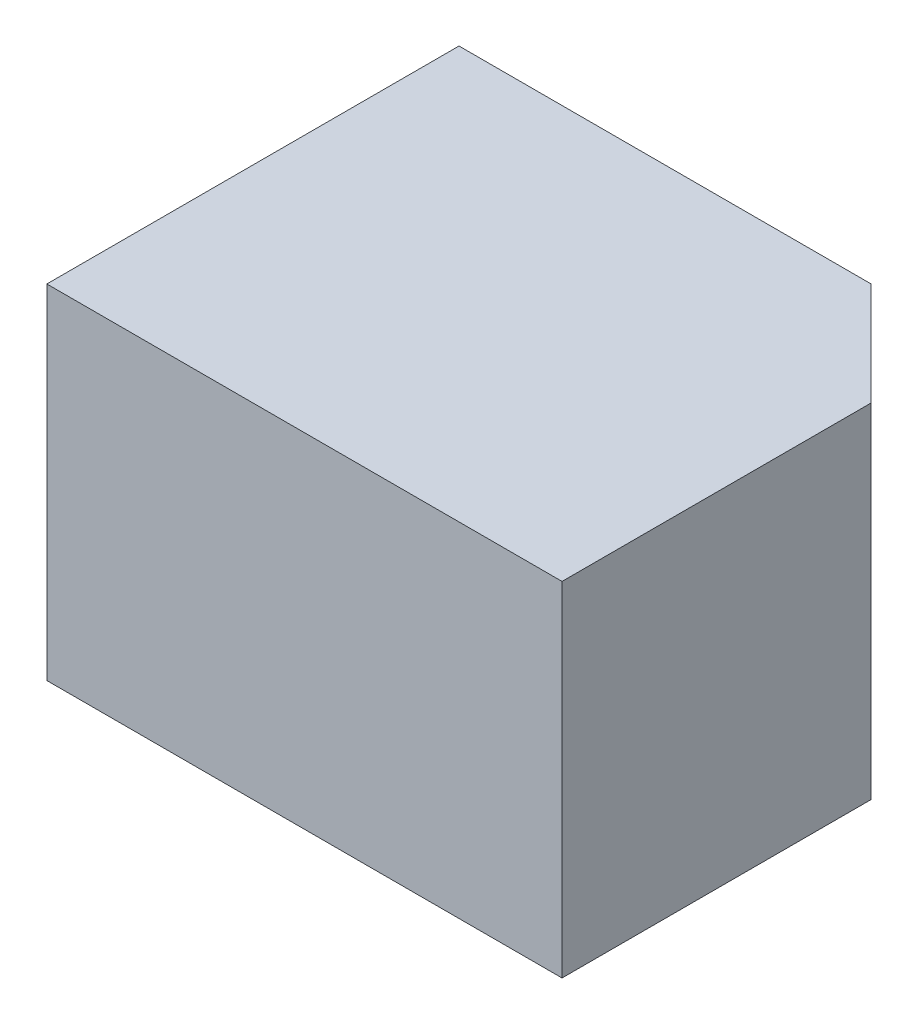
ISO-10303-21;
HEADER;
FILE_DESCRIPTION(('STEP AP214'),'2;1');
FILE_NAME('part.step','',(''),(''),'','','');
FILE_SCHEMA(('AUTOMOTIVE_DESIGN { 1 0 10303 214 1 1 1 1 }'));
ENDSEC;
DATA;
#1=APPLICATION_CONTEXT('core data for automotive mechanical design processes');
#2=APPLICATION_PROTOCOL_DEFINITION('international standard','automotive_design',2000,#1);
#3=PRODUCT_CONTEXT('',#1,'mechanical');
#4=PRODUCT('Part','Part','',(#3));
#5=PRODUCT_RELATED_PRODUCT_CATEGORY('part','',(#4));
#6=PRODUCT_DEFINITION_FORMATION('','',#4);
#7=PRODUCT_DEFINITION_CONTEXT('part definition',#1,'design');
#8=PRODUCT_DEFINITION('design','',#6,#7);
#9=PRODUCT_DEFINITION_SHAPE('','',#8);
#10=(LENGTH_UNIT() NAMED_UNIT(*) SI_UNIT(.MILLI.,.METRE.));
#11=(NAMED_UNIT(*) PLANE_ANGLE_UNIT() SI_UNIT($,.RADIAN.));
#12=(NAMED_UNIT(*) SI_UNIT($,.STERADIAN.) SOLID_ANGLE_UNIT());
#13=UNCERTAINTY_MEASURE_WITH_UNIT(LENGTH_MEASURE(1.E-05),#10,'distance_accuracy_value','');
#14=(GEOMETRIC_REPRESENTATION_CONTEXT(3) GLOBAL_UNCERTAINTY_ASSIGNED_CONTEXT((#13)) GLOBAL_UNIT_ASSIGNED_CONTEXT((#10,
#11,#12)) REPRESENTATION_CONTEXT('',''));
#15=CARTESIAN_POINT('',(0.,0.,0.));
#16=DIRECTION('',(0.,0.,1.));
#17=DIRECTION('',(1.,0.,0.));
#18=AXIS2_PLACEMENT_3D('',#15,#16,#17);
#19=CARTESIAN_POINT('',(-4.42379489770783,5.,-3.53903591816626));
#20=DIRECTION('',(1.,0.,0.));
#21=DIRECTION('',(0.,0.,-1.));
#22=AXIS2_PLACEMENT_3D('',#19,#20,#21);
#23=PLANE('',#22);
#24=DIRECTION('',(0.,0.,1.));
#25=VECTOR('',#24,1.);
#26=CARTESIAN_POINT('',(-4.42379489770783,0.,-3.53903591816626));
#27=LINE('',#26,#25);
#28=CARTESIAN_POINT('',(-4.42379489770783,0.,-3.53903591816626));
#29=VERTEX_POINT('',#28);
#30=CARTESIAN_POINT('',(-4.42379489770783,0.,2.46096408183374));
#31=VERTEX_POINT('',#30);
#32=EDGE_CURVE('E126',#29,#31,#27,.T.);
#33=ORIENTED_EDGE('',*,*,#32,.T.);
#34=DIRECTION('',(0.,-1.,0.));
#35=VECTOR('',#34,1.);
#36=CARTESIAN_POINT('',(-4.42379489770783,5.,2.46096408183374));
#37=LINE('',#36,#35);
#38=CARTESIAN_POINT('',(-4.42379489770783,5.,2.46096408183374));
#39=VERTEX_POINT('',#38);
#40=EDGE_CURVE('E44',#39,#31,#37,.T.);
#41=ORIENTED_EDGE('',*,*,#40,.F.);
#42=DIRECTION('',(0.,0.,1.));
#43=VECTOR('',#42,1.);
#44=CARTESIAN_POINT('',(-4.42379489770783,5.,-3.53903591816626));
#45=LINE('',#44,#43);
#46=CARTESIAN_POINT('',(-4.42379489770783,5.,-3.53903591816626));
#47=VERTEX_POINT('',#46);
#48=EDGE_CURVE('E137',#47,#39,#45,.T.);
#49=ORIENTED_EDGE('',*,*,#48,.F.);
#50=DIRECTION('',(0.,-1.,0.));
#51=VECTOR('',#50,1.);
#52=CARTESIAN_POINT('',(-4.42379489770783,5.,-3.53903591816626));
#53=LINE('',#52,#51);
#54=EDGE_CURVE('E122',#47,#29,#53,.T.);
#55=ORIENTED_EDGE('',*,*,#54,.T.);
#56=EDGE_LOOP('',(#33,#41,#49,#55));
#57=FACE_BOUND('',#56,.T.);
#58=ADVANCED_FACE('F37',(#57),#23,.F.);
#59=CARTESIAN_POINT('',(3.07620510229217,5.,2.46096408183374));
#60=DIRECTION('',(0.,0.,-1.));
#61=DIRECTION('',(-1.,0.,0.));
#62=AXIS2_PLACEMENT_3D('',#59,#60,#61);
#63=PLANE('',#62);
#64=DIRECTION('',(1.,0.,0.));
#65=VECTOR('',#64,1.);
#66=CARTESIAN_POINT('',(3.07620510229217,0.,2.46096408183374));
#67=LINE('',#66,#65);
#68=CARTESIAN_POINT('',(3.07620510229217,0.,2.46096408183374));
#69=VERTEX_POINT('',#68);
#70=EDGE_CURVE('E129',#31,#69,#67,.T.);
#71=ORIENTED_EDGE('',*,*,#70,.T.);
#72=DIRECTION('',(0.,-1.,0.));
#73=VECTOR('',#72,1.);
#74=CARTESIAN_POINT('',(3.07620510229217,5.,2.46096408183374));
#75=LINE('',#74,#73);
#76=CARTESIAN_POINT('',(3.07620510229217,5.,2.46096408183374));
#77=VERTEX_POINT('',#76);
#78=EDGE_CURVE('E116',#77,#69,#75,.T.);
#79=ORIENTED_EDGE('',*,*,#78,.F.);
#80=DIRECTION('',(1.,0.,0.));
#81=VECTOR('',#80,1.);
#82=CARTESIAN_POINT('',(3.07620510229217,5.,2.46096408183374));
#83=LINE('',#82,#81);
#84=EDGE_CURVE('E93',#39,#77,#83,.T.);
#85=ORIENTED_EDGE('',*,*,#84,.F.);
#86=ORIENTED_EDGE('',*,*,#40,.T.);
#87=EDGE_LOOP('',(#71,#79,#85,#86));
#88=FACE_BOUND('',#87,.T.);
#89=ADVANCED_FACE('F141',(#88),#63,.F.);
#90=CARTESIAN_POINT('',(3.07620510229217,5.,-2.03903591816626));
#91=DIRECTION('',(-1.,0.,0.));
#92=DIRECTION('',(0.,0.,1.));
#93=AXIS2_PLACEMENT_3D('',#90,#91,#92);
#94=PLANE('',#93);
#95=DIRECTION('',(0.,0.,-1.));
#96=VECTOR('',#95,1.);
#97=CARTESIAN_POINT('',(3.07620510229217,0.,-2.03903591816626));
#98=LINE('',#97,#96);
#99=CARTESIAN_POINT('',(3.07620510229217,0.,-2.03903591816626));
#100=VERTEX_POINT('',#99);
#101=EDGE_CURVE('E112',#69,#100,#98,.T.);
#102=ORIENTED_EDGE('',*,*,#101,.T.);
#103=DIRECTION('',(0.,-1.,0.));
#104=VECTOR('',#103,1.);
#105=CARTESIAN_POINT('',(3.07620510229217,5.,-2.03903591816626));
#106=LINE('',#105,#104);
#107=CARTESIAN_POINT('',(3.07620510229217,5.,-2.03903591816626));
#108=VERTEX_POINT('',#107);
#109=EDGE_CURVE('E109',#108,#100,#106,.T.);
#110=ORIENTED_EDGE('',*,*,#109,.F.);
#111=DIRECTION('',(0.,0.,-1.));
#112=VECTOR('',#111,1.);
#113=CARTESIAN_POINT('',(3.07620510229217,5.,-2.03903591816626));
#114=LINE('',#113,#112);
#115=EDGE_CURVE('E99',#77,#108,#114,.T.);
#116=ORIENTED_EDGE('',*,*,#115,.F.);
#117=ORIENTED_EDGE('',*,*,#78,.T.);
#118=EDGE_LOOP('',(#102,#110,#116,#117));
#119=FACE_BOUND('',#118,.T.);
#120=ADVANCED_FACE('F110',(#119),#94,.F.);
#121=CARTESIAN_POINT('',(1.57620510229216,5.,-3.53903591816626));
#122=DIRECTION('',(-0.707106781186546,0.,0.707106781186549));
#123=DIRECTION('',(0.707106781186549,0.,0.707106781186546));
#124=AXIS2_PLACEMENT_3D('',#121,#122,#123);
#125=PLANE('',#124);
#126=DIRECTION('',(0.707106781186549,0.,0.707106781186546));
#127=VECTOR('',#126,1.);
#128=CARTESIAN_POINT('',(1.57620510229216,0.79,-3.53903591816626));
#129=LINE('',#128,#127);
#130=CARTESIAN_POINT('',(1.78241219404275,0.79,-3.33282882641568));
#131=VERTEX_POINT('',#130);
#132=CARTESIAN_POINT('',(2.61999801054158,0.79,-2.49524300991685));
#133=VERTEX_POINT('',#132);
#134=EDGE_CURVE('E12',#131,#133,#129,.T.);
#135=ORIENTED_EDGE('',*,*,#134,.F.);
#136=DIRECTION('',(0.,-1.,0.));
#137=VECTOR('',#136,1.);
#138=CARTESIAN_POINT('',(1.78241219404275,0.79,-3.33282882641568));
#139=LINE('',#138,#137);
#140=CARTESIAN_POINT('',(1.78241219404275,0.,-3.33282882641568));
#141=VERTEX_POINT('',#140);
#142=EDGE_CURVE('E154',#131,#141,#139,.T.);
#143=ORIENTED_EDGE('',*,*,#142,.T.);
#144=DIRECTION('',(-0.707106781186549,0.,-0.707106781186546));
#145=VECTOR('',#144,1.);
#146=CARTESIAN_POINT('',(1.57620510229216,0.,-3.53903591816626));
#147=LINE('',#146,#145);
#148=CARTESIAN_POINT('',(1.57620510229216,0.,-3.53903591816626));
#149=VERTEX_POINT('',#148);
#150=EDGE_CURVE('E133',#141,#149,#147,.T.);
#151=ORIENTED_EDGE('',*,*,#150,.T.);
#152=DIRECTION('',(0.,-1.,0.));
#153=VECTOR('',#152,1.);
#154=CARTESIAN_POINT('',(1.57620510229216,5.,-3.53903591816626));
#155=LINE('',#154,#153);
#156=CARTESIAN_POINT('',(1.57620510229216,5.,-3.53903591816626));
#157=VERTEX_POINT('',#156);
#158=EDGE_CURVE('E117',#157,#149,#155,.T.);
#159=ORIENTED_EDGE('',*,*,#158,.F.);
#160=DIRECTION('',(-0.707106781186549,0.,-0.707106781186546));
#161=VECTOR('',#160,1.);
#162=CARTESIAN_POINT('',(1.57620510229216,5.,-3.53903591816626));
#163=LINE('',#162,#161);
#164=EDGE_CURVE('E103',#108,#157,#163,.T.);
#165=ORIENTED_EDGE('',*,*,#164,.F.);
#166=ORIENTED_EDGE('',*,*,#109,.T.);
#167=CARTESIAN_POINT('',(2.61999801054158,0.,-2.49524300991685));
#168=VERTEX_POINT('',#167);
#169=EDGE_CURVE('E134',#100,#168,#147,.T.);
#170=ORIENTED_EDGE('',*,*,#169,.T.);
#171=DIRECTION('',(0.,-1.,0.));
#172=VECTOR('',#171,1.);
#173=CARTESIAN_POINT('',(2.61999801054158,0.79,-2.49524300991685));
#174=LINE('',#173,#172);
#175=EDGE_CURVE('E51',#168,#133,#174,.F.);
#176=ORIENTED_EDGE('',*,*,#175,.T.);
#177=EDGE_LOOP('',(#135,#143,#151,#159,#165,#166,#170,#176));
#178=FACE_BOUND('',#177,.T.);
#179=ADVANCED_FACE('F120',(#178),#125,.F.);
#180=CARTESIAN_POINT('',(1.57620510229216,5.,-3.53903591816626));
#181=DIRECTION('',(0.,0.,1.));
#182=DIRECTION('',(1.,0.,0.));
#183=AXIS2_PLACEMENT_3D('',#180,#181,#182);
#184=PLANE('',#183);
#185=DIRECTION('',(-1.,0.,0.));
#186=VECTOR('',#185,1.);
#187=CARTESIAN_POINT('',(1.57620510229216,0.,-3.53903591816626));
#188=LINE('',#187,#186);
#189=EDGE_CURVE('E84',#149,#29,#188,.T.);
#190=ORIENTED_EDGE('',*,*,#189,.T.);
#191=ORIENTED_EDGE('',*,*,#54,.F.);
#192=DIRECTION('',(-1.,0.,0.));
#193=VECTOR('',#192,1.);
#194=CARTESIAN_POINT('',(1.57620510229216,5.,-3.53903591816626));
#195=LINE('',#194,#193);
#196=EDGE_CURVE('E60',#157,#47,#195,.T.);
#197=ORIENTED_EDGE('',*,*,#196,.F.);
#198=ORIENTED_EDGE('',*,*,#158,.T.);
#199=EDGE_LOOP('',(#190,#191,#197,#198));
#200=FACE_BOUND('',#199,.T.);
#201=ADVANCED_FACE('F207',(#200),#184,.F.);
#202=CARTESIAN_POINT('',(0.,5.,0.));
#203=DIRECTION('',(0.,-1.,0.));
#204=DIRECTION('',(0.,0.,-1.));
#205=AXIS2_PLACEMENT_3D('',#202,#203,#204);
#206=PLANE('',#205);
#207=ORIENTED_EDGE('',*,*,#48,.T.);
#208=ORIENTED_EDGE('',*,*,#84,.T.);
#209=ORIENTED_EDGE('',*,*,#115,.T.);
#210=ORIENTED_EDGE('',*,*,#164,.T.);
#211=ORIENTED_EDGE('',*,*,#196,.T.);
#212=EDGE_LOOP('',(#207,#208,#209,#210,#211));
#213=FACE_BOUND('',#212,.T.);
#214=ADVANCED_FACE('F101',(#213),#206,.F.);
#215=CARTESIAN_POINT('',(0.,0.,0.));
#216=DIRECTION('',(0.,-1.,0.));
#217=DIRECTION('',(0.,0.,-1.));
#218=AXIS2_PLACEMENT_3D('',#215,#216,#217);
#219=PLANE('',#218);
#220=CARTESIAN_POINT('',(-3.17379489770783,0.,-2.53903591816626));
#221=DIRECTION('',(0.,-1.,0.));
#222=DIRECTION('',(0.,0.,-1.));
#223=AXIS2_PLACEMENT_3D('',#220,#221,#222);
#224=CIRCLE('',#223,0.795);
#225=CARTESIAN_POINT('',(-3.17379489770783,0.,-3.33403591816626));
#226=VERTEX_POINT('',#225);
#227=EDGE_CURVE('E339',#226,#226,#224,.T.);
#228=ORIENTED_EDGE('',*,*,#227,.F.);
#229=EDGE_LOOP('',(#228));
#230=FACE_BOUND('',#229,.T.);
#231=CARTESIAN_POINT('',(1.82620510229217,0.,-2.53903591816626));
#232=DIRECTION('',(0.,-1.,0.));
#233=DIRECTION('',(0.,0.,-1.));
#234=AXIS2_PLACEMENT_3D('',#231,#232,#233);
#235=CIRCLE('',#234,0.795000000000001);
#236=EDGE_CURVE('E149',#168,#141,#235,.T.);
#237=ORIENTED_EDGE('',*,*,#236,.F.);
#238=ORIENTED_EDGE('',*,*,#169,.F.);
#239=ORIENTED_EDGE('',*,*,#101,.F.);
#240=ORIENTED_EDGE('',*,*,#70,.F.);
#241=ORIENTED_EDGE('',*,*,#32,.F.);
#242=ORIENTED_EDGE('',*,*,#189,.F.);
#243=ORIENTED_EDGE('',*,*,#150,.F.);
#244=EDGE_LOOP('',(#237,#238,#239,#240,#241,#242,#243));
#245=FACE_BOUND('',#244,.T.);
#246=CARTESIAN_POINT('',(1.82620510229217,0.,1.46096408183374));
#247=DIRECTION('',(0.,-1.,0.));
#248=DIRECTION('',(0.,0.,-1.));
#249=AXIS2_PLACEMENT_3D('',#246,#247,#248);
#250=CIRCLE('',#249,0.795000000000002);
#251=CARTESIAN_POINT('',(1.82620510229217,0.,0.665964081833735));
#252=VERTEX_POINT('',#251);
#253=EDGE_CURVE('E157',#252,#252,#250,.T.);
#254=ORIENTED_EDGE('',*,*,#253,.F.);
#255=EDGE_LOOP('',(#254));
#256=FACE_BOUND('',#255,.T.);
#257=CARTESIAN_POINT('',(-3.17379489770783,0.,1.46096408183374));
#258=DIRECTION('',(0.,-1.,0.));
#259=DIRECTION('',(0.,0.,-1.));
#260=AXIS2_PLACEMENT_3D('',#257,#258,#259);
#261=CIRCLE('',#260,0.795);
#262=CARTESIAN_POINT('',(-3.17379489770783,0.,0.665964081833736));
#263=VERTEX_POINT('',#262);
#264=EDGE_CURVE('E166',#263,#263,#261,.T.);
#265=ORIENTED_EDGE('',*,*,#264,.F.);
#266=EDGE_LOOP('',(#265));
#267=FACE_BOUND('',#266,.T.);
#268=CARTESIAN_POINT('',(-1.17379489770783,0.,-0.539035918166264));
#269=DIRECTION('',(0.,-1.,0.));
#270=DIRECTION('',(0.,0.,-1.));
#271=AXIS2_PLACEMENT_3D('',#268,#269,#270);
#272=CIRCLE('',#271,1.25);
#273=CARTESIAN_POINT('',(-1.17379489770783,0.,-1.78903591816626));
#274=VERTEX_POINT('',#273);
#275=EDGE_CURVE('E172',#274,#274,#272,.T.);
#276=ORIENTED_EDGE('',*,*,#275,.F.);
#277=EDGE_LOOP('',(#276));
#278=FACE_BOUND('',#277,.T.);
#279=ADVANCED_FACE('F146',(#230,#245,#256,#267,#278),#219,.T.);
#280=CARTESIAN_POINT('',(-1.17379489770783,8.53553390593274,-0.539035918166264));
#281=DIRECTION('',(0.,-1.,0.));
#282=DIRECTION('',(0.,0.,-1.));
#283=AXIS2_PLACEMENT_3D('',#280,#281,#282);
#284=CYLINDRICAL_SURFACE('',#283,1.25);
#285=CARTESIAN_POINT('',(-1.17379489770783,4.,-0.539035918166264));
#286=DIRECTION('',(0.,-1.,0.));
#287=DIRECTION('',(0.,0.,-1.));
#288=AXIS2_PLACEMENT_3D('',#285,#286,#287);
#289=CIRCLE('',#288,1.25);
#290=CARTESIAN_POINT('',(-1.17379489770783,4.,-1.78903591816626));
#291=VERTEX_POINT('',#290);
#292=EDGE_CURVE('E130',#291,#291,#289,.F.);
#293=ORIENTED_EDGE('',*,*,#292,.T.);
#294=EDGE_LOOP('',(#293));
#295=FACE_BOUND('',#294,.T.);
#296=ORIENTED_EDGE('',*,*,#275,.T.);
#297=EDGE_LOOP('',(#296));
#298=FACE_BOUND('',#297,.T.);
#299=ADVANCED_FACE('F181',(#295,#298),#284,.F.);
#300=CARTESIAN_POINT('',(0.,4.,0.));
#301=DIRECTION('',(0.,-1.,0.));
#302=DIRECTION('',(0.,0.,-1.));
#303=AXIS2_PLACEMENT_3D('',#300,#301,#302);
#304=PLANE('',#303);
#305=ORIENTED_EDGE('',*,*,#292,.F.);
#306=EDGE_LOOP('',(#305));
#307=FACE_BOUND('',#306,.T.);
#308=ADVANCED_FACE('F184',(#307),#304,.T.);
#309=CARTESIAN_POINT('',(-3.17379489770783,0.79,1.46096408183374));
#310=DIRECTION('',(0.,-1.,0.));
#311=DIRECTION('',(0.,0.,-1.));
#312=AXIS2_PLACEMENT_3D('',#309,#310,#311);
#313=CYLINDRICAL_SURFACE('',#312,0.795);
#314=CARTESIAN_POINT('',(-3.17379489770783,0.79,1.46096408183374));
#315=DIRECTION('',(0.,-1.,0.));
#316=DIRECTION('',(0.,0.,-1.));
#317=AXIS2_PLACEMENT_3D('',#314,#315,#316);
#318=CIRCLE('',#317,0.795);
#319=CARTESIAN_POINT('',(-3.17379489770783,0.79,0.665964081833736));
#320=VERTEX_POINT('',#319);
#321=EDGE_CURVE('E169',#320,#320,#318,.T.);
#322=CARTESIAN_POINT('',(-3.17379489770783,0.79,0.665964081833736));
#323=CARTESIAN_POINT('',(-3.17379489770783,0.781770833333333,0.665964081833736));
#324=CARTESIAN_POINT('',(-3.17379489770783,0.773541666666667,0.665964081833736));
#325=CARTESIAN_POINT('',(-3.17379489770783,0.757083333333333,0.665964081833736));
#326=CARTESIAN_POINT('',(-3.17379489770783,0.748854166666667,0.665964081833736));
#327=CARTESIAN_POINT('',(-3.17379489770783,0.732395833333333,0.665964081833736));
#328=CARTESIAN_POINT('',(-3.17379489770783,0.724166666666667,0.665964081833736));
#329=CARTESIAN_POINT('',(-3.17379489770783,0.707708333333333,0.665964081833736));
#330=CARTESIAN_POINT('',(-3.17379489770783,0.699479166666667,0.665964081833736));
#331=CARTESIAN_POINT('',(-3.17379489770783,0.683020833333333,0.665964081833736));
#332=CARTESIAN_POINT('',(-3.17379489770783,0.674791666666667,0.665964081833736));
#333=CARTESIAN_POINT('',(-3.17379489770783,0.658333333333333,0.665964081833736));
#334=CARTESIAN_POINT('',(-3.17379489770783,0.650104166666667,0.665964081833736));
#335=CARTESIAN_POINT('',(-3.17379489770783,0.633645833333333,0.665964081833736));
#336=CARTESIAN_POINT('',(-3.17379489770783,0.625416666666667,0.665964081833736));
#337=CARTESIAN_POINT('',(-3.17379489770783,0.608958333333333,0.665964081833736));
#338=CARTESIAN_POINT('',(-3.17379489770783,0.600729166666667,0.665964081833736));
#339=CARTESIAN_POINT('',(-3.17379489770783,0.584270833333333,0.665964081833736));
#340=CARTESIAN_POINT('',(-3.17379489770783,0.576041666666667,0.665964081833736));
#341=CARTESIAN_POINT('',(-3.17379489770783,0.559583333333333,0.665964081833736));
#342=CARTESIAN_POINT('',(-3.17379489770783,0.551354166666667,0.665964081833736));
#343=CARTESIAN_POINT('',(-3.17379489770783,0.534895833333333,0.665964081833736));
#344=CARTESIAN_POINT('',(-3.17379489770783,0.526666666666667,0.665964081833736));
#345=CARTESIAN_POINT('',(-3.17379489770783,0.510208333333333,0.665964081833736));
#346=CARTESIAN_POINT('',(-3.17379489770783,0.501979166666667,0.665964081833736));
#347=CARTESIAN_POINT('',(-3.17379489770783,0.485520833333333,0.665964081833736));
#348=CARTESIAN_POINT('',(-3.17379489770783,0.477291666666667,0.665964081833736));
#349=CARTESIAN_POINT('',(-3.17379489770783,0.460833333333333,0.665964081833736));
#350=CARTESIAN_POINT('',(-3.17379489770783,0.452604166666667,0.665964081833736));
#351=CARTESIAN_POINT('',(-3.17379489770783,0.436145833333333,0.665964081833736));
#352=CARTESIAN_POINT('',(-3.17379489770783,0.427916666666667,0.665964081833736));
#353=CARTESIAN_POINT('',(-3.17379489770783,0.411458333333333,0.665964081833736));
#354=CARTESIAN_POINT('',(-3.17379489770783,0.403229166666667,0.665964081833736));
#355=CARTESIAN_POINT('',(-3.17379489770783,0.386770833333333,0.665964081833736));
#356=CARTESIAN_POINT('',(-3.17379489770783,0.378541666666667,0.665964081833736));
#357=CARTESIAN_POINT('',(-3.17379489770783,0.362083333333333,0.665964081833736));
#358=CARTESIAN_POINT('',(-3.17379489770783,0.353854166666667,0.665964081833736));
#359=CARTESIAN_POINT('',(-3.17379489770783,0.337395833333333,0.665964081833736));
#360=CARTESIAN_POINT('',(-3.17379489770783,0.329166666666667,0.665964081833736));
#361=CARTESIAN_POINT('',(-3.17379489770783,0.312708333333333,0.665964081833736));
#362=CARTESIAN_POINT('',(-3.17379489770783,0.304479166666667,0.665964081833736));
#363=CARTESIAN_POINT('',(-3.17379489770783,0.288020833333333,0.665964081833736));
#364=CARTESIAN_POINT('',(-3.17379489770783,0.279791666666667,0.665964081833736));
#365=CARTESIAN_POINT('',(-3.17379489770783,0.263333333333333,0.665964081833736));
#366=CARTESIAN_POINT('',(-3.17379489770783,0.255104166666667,0.665964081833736));
#367=CARTESIAN_POINT('',(-3.17379489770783,0.238645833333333,0.665964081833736));
#368=CARTESIAN_POINT('',(-3.17379489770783,0.230416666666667,0.665964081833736));
#369=CARTESIAN_POINT('',(-3.17379489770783,0.213958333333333,0.665964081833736));
#370=CARTESIAN_POINT('',(-3.17379489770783,0.205729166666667,0.665964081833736));
#371=CARTESIAN_POINT('',(-3.17379489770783,0.189270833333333,0.665964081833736));
#372=CARTESIAN_POINT('',(-3.17379489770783,0.181041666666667,0.665964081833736));
#373=CARTESIAN_POINT('',(-3.17379489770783,0.164583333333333,0.665964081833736));
#374=CARTESIAN_POINT('',(-3.17379489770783,0.156354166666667,0.665964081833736));
#375=CARTESIAN_POINT('',(-3.17379489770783,0.139895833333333,0.665964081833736));
#376=CARTESIAN_POINT('',(-3.17379489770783,0.131666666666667,0.665964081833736));
#377=CARTESIAN_POINT('',(-3.17379489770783,0.115208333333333,0.665964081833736));
#378=CARTESIAN_POINT('',(-3.17379489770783,0.106979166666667,0.665964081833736));
#379=CARTESIAN_POINT('',(-3.17379489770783,0.0905208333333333,0.665964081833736));
#380=CARTESIAN_POINT('',(-3.17379489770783,0.0822916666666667,0.665964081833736));
#381=CARTESIAN_POINT('',(-3.17379489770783,0.0658333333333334,0.665964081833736));
#382=CARTESIAN_POINT('',(-3.17379489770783,0.0576041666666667,0.665964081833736));
#383=CARTESIAN_POINT('',(-3.17379489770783,0.0411458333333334,0.665964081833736));
#384=CARTESIAN_POINT('',(-3.17379489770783,0.0329166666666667,0.665964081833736));
#385=CARTESIAN_POINT('',(-3.17379489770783,0.0164583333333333,0.665964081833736));
#386=CARTESIAN_POINT('',(-3.17379489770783,0.00822916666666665,0.665964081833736));
#387=CARTESIAN_POINT('',(-3.17379489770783,0.,0.665964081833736));
#388=B_SPLINE_CURVE_WITH_KNOTS('',3,(#322,#323,#324,#325,#326,#327,#328,#329,#330,#331,#332,
#333,#334,#335,#336,#337,#338,#339,#340,#341,#342,#343,#344,#345,#346,#347,#348,#349,#350,#351,
#352,#353,#354,#355,#356,#357,#358,#359,#360,#361,#362,#363,#364,#365,#366,#367,#368,#369,#370,
#371,#372,#373,#374,#375,#376,#377,#378,#379,#380,#381,#382,#383,#384,#385,#386,#387),
.UNSPECIFIED.,.F.,.F.,(4,2,2,2,2,2,2,2,2,2,2,2,2,2,2,2,2,2,2,2,2,2,2,2,2,2,2,2,2,2,2,2,4),(0.,
0.0246875,0.0493749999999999,0.0740624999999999,0.09875,0.1234375,0.148125,0.1728125,0.1975,
0.2221875,0.246875,0.2715625,0.29625,0.3209375,0.345625,0.3703125,0.395,0.4196875,0.444375,
0.4690625,0.49375,0.5184375,0.543125,0.5678125,0.5925,0.6171875,0.641875,0.6665625,0.69125,
0.7159375,0.740625,0.7653125,0.79),.UNSPECIFIED.);
#389=EDGE_CURVE('BSEAM186',#320,#263,#388,.T.);
#390=ORIENTED_EDGE('',*,*,#321,.F.);
#391=ORIENTED_EDGE('',*,*,#264,.T.);
#392=ORIENTED_EDGE('',*,*,#389,.T.);
#393=ORIENTED_EDGE('',*,*,#389,.F.);
#394=EDGE_LOOP('',(#390,#392,#391,#393));
#395=FACE_BOUND('',#394,.T.);
#396=ADVANCED_FACE('F186',(#395),#313,.F.);
#397=CARTESIAN_POINT('',(-3.17379489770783,0.79,1.46096408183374));
#398=DIRECTION('',(0.,-1.,0.));
#399=DIRECTION('',(0.,0.,-1.));
#400=AXIS2_PLACEMENT_3D('',#397,#398,#399);
#401=PLANE('',#400);
#402=ORIENTED_EDGE('',*,*,#321,.T.);
#403=EDGE_LOOP('',(#402));
#404=FACE_BOUND('',#403,.T.);
#405=ADVANCED_FACE('F192',(#404),#401,.T.);
#406=CARTESIAN_POINT('',(1.82620510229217,0.79,1.46096408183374));
#407=DIRECTION('',(0.,-1.,0.));
#408=DIRECTION('',(0.,0.,-1.));
#409=AXIS2_PLACEMENT_3D('',#406,#407,#408);
#410=CYLINDRICAL_SURFACE('',#409,0.795000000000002);
#411=CARTESIAN_POINT('',(1.82620510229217,0.79,1.46096408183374));
#412=DIRECTION('',(0.,-1.,0.));
#413=DIRECTION('',(0.,0.,-1.));
#414=AXIS2_PLACEMENT_3D('',#411,#412,#413);
#415=CIRCLE('',#414,0.795000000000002);
#416=CARTESIAN_POINT('',(1.82620510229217,0.79,0.665964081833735));
#417=VERTEX_POINT('',#416);
#418=EDGE_CURVE('E163',#417,#417,#415,.T.);
#419=CARTESIAN_POINT('',(1.82620510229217,0.79,0.665964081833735));
#420=CARTESIAN_POINT('',(1.82620510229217,0.781770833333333,0.665964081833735));
#421=CARTESIAN_POINT('',(1.82620510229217,0.773541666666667,0.665964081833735));
#422=CARTESIAN_POINT('',(1.82620510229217,0.757083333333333,0.665964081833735));
#423=CARTESIAN_POINT('',(1.82620510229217,0.748854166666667,0.665964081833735));
#424=CARTESIAN_POINT('',(1.82620510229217,0.732395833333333,0.665964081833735));
#425=CARTESIAN_POINT('',(1.82620510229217,0.724166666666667,0.665964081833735));
#426=CARTESIAN_POINT('',(1.82620510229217,0.707708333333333,0.665964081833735));
#427=CARTESIAN_POINT('',(1.82620510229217,0.699479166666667,0.665964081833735));
#428=CARTESIAN_POINT('',(1.82620510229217,0.683020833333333,0.665964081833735));
#429=CARTESIAN_POINT('',(1.82620510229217,0.674791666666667,0.665964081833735));
#430=CARTESIAN_POINT('',(1.82620510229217,0.658333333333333,0.665964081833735));
#431=CARTESIAN_POINT('',(1.82620510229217,0.650104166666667,0.665964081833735));
#432=CARTESIAN_POINT('',(1.82620510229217,0.633645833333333,0.665964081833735));
#433=CARTESIAN_POINT('',(1.82620510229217,0.625416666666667,0.665964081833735));
#434=CARTESIAN_POINT('',(1.82620510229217,0.608958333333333,0.665964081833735));
#435=CARTESIAN_POINT('',(1.82620510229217,0.600729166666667,0.665964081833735));
#436=CARTESIAN_POINT('',(1.82620510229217,0.584270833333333,0.665964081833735));
#437=CARTESIAN_POINT('',(1.82620510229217,0.576041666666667,0.665964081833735));
#438=CARTESIAN_POINT('',(1.82620510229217,0.559583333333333,0.665964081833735));
#439=CARTESIAN_POINT('',(1.82620510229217,0.551354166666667,0.665964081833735));
#440=CARTESIAN_POINT('',(1.82620510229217,0.534895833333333,0.665964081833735));
#441=CARTESIAN_POINT('',(1.82620510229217,0.526666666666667,0.665964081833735));
#442=CARTESIAN_POINT('',(1.82620510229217,0.510208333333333,0.665964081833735));
#443=CARTESIAN_POINT('',(1.82620510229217,0.501979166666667,0.665964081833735));
#444=CARTESIAN_POINT('',(1.82620510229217,0.485520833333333,0.665964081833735));
#445=CARTESIAN_POINT('',(1.82620510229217,0.477291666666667,0.665964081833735));
#446=CARTESIAN_POINT('',(1.82620510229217,0.460833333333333,0.665964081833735));
#447=CARTESIAN_POINT('',(1.82620510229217,0.452604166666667,0.665964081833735));
#448=CARTESIAN_POINT('',(1.82620510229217,0.436145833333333,0.665964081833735));
#449=CARTESIAN_POINT('',(1.82620510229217,0.427916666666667,0.665964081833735));
#450=CARTESIAN_POINT('',(1.82620510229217,0.411458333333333,0.665964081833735));
#451=CARTESIAN_POINT('',(1.82620510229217,0.403229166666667,0.665964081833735));
#452=CARTESIAN_POINT('',(1.82620510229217,0.386770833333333,0.665964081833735));
#453=CARTESIAN_POINT('',(1.82620510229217,0.378541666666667,0.665964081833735));
#454=CARTESIAN_POINT('',(1.82620510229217,0.362083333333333,0.665964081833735));
#455=CARTESIAN_POINT('',(1.82620510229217,0.353854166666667,0.665964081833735));
#456=CARTESIAN_POINT('',(1.82620510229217,0.337395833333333,0.665964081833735));
#457=CARTESIAN_POINT('',(1.82620510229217,0.329166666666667,0.665964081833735));
#458=CARTESIAN_POINT('',(1.82620510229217,0.312708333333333,0.665964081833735));
#459=CARTESIAN_POINT('',(1.82620510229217,0.304479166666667,0.665964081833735));
#460=CARTESIAN_POINT('',(1.82620510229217,0.288020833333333,0.665964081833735));
#461=CARTESIAN_POINT('',(1.82620510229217,0.279791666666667,0.665964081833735));
#462=CARTESIAN_POINT('',(1.82620510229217,0.263333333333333,0.665964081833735));
#463=CARTESIAN_POINT('',(1.82620510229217,0.255104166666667,0.665964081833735));
#464=CARTESIAN_POINT('',(1.82620510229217,0.238645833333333,0.665964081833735));
#465=CARTESIAN_POINT('',(1.82620510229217,0.230416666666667,0.665964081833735));
#466=CARTESIAN_POINT('',(1.82620510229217,0.213958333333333,0.665964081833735));
#467=CARTESIAN_POINT('',(1.82620510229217,0.205729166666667,0.665964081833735));
#468=CARTESIAN_POINT('',(1.82620510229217,0.189270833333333,0.665964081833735));
#469=CARTESIAN_POINT('',(1.82620510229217,0.181041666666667,0.665964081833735));
#470=CARTESIAN_POINT('',(1.82620510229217,0.164583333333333,0.665964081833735));
#471=CARTESIAN_POINT('',(1.82620510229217,0.156354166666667,0.665964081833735));
#472=CARTESIAN_POINT('',(1.82620510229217,0.139895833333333,0.665964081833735));
#473=CARTESIAN_POINT('',(1.82620510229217,0.131666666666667,0.665964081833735));
#474=CARTESIAN_POINT('',(1.82620510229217,0.115208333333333,0.665964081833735));
#475=CARTESIAN_POINT('',(1.82620510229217,0.106979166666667,0.665964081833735));
#476=CARTESIAN_POINT('',(1.82620510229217,0.0905208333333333,0.665964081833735));
#477=CARTESIAN_POINT('',(1.82620510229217,0.0822916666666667,0.665964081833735));
#478=CARTESIAN_POINT('',(1.82620510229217,0.0658333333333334,0.665964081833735));
#479=CARTESIAN_POINT('',(1.82620510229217,0.0576041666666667,0.665964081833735));
#480=CARTESIAN_POINT('',(1.82620510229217,0.0411458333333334,0.665964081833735));
#481=CARTESIAN_POINT('',(1.82620510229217,0.0329166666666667,0.665964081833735));
#482=CARTESIAN_POINT('',(1.82620510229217,0.0164583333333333,0.665964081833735));
#483=CARTESIAN_POINT('',(1.82620510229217,0.00822916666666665,0.665964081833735));
#484=CARTESIAN_POINT('',(1.82620510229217,0.,0.665964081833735));
#485=B_SPLINE_CURVE_WITH_KNOTS('',3,(#419,#420,#421,#422,#423,#424,#425,#426,#427,#428,#429,
#430,#431,#432,#433,#434,#435,#436,#437,#438,#439,#440,#441,#442,#443,#444,#445,#446,#447,#448,
#449,#450,#451,#452,#453,#454,#455,#456,#457,#458,#459,#460,#461,#462,#463,#464,#465,#466,#467,
#468,#469,#470,#471,#472,#473,#474,#475,#476,#477,#478,#479,#480,#481,#482,#483,#484),
.UNSPECIFIED.,.F.,.F.,(4,2,2,2,2,2,2,2,2,2,2,2,2,2,2,2,2,2,2,2,2,2,2,2,2,2,2,2,2,2,2,2,4),(0.,
0.0246875,0.0493749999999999,0.0740624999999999,0.09875,0.1234375,0.148125,0.1728125,0.1975,
0.2221875,0.246875,0.2715625,0.29625,0.3209375,0.345625,0.3703125,0.395,0.4196875,0.444375,
0.4690625,0.49375,0.5184375,0.543125,0.5678125,0.5925,0.6171875,0.641875,0.6665625,0.69125,
0.7159375,0.740625,0.7653125,0.79),.UNSPECIFIED.);
#486=EDGE_CURVE('BSEAM273',#417,#252,#485,.T.);
#487=ORIENTED_EDGE('',*,*,#418,.F.);
#488=ORIENTED_EDGE('',*,*,#253,.T.);
#489=ORIENTED_EDGE('',*,*,#486,.T.);
#490=ORIENTED_EDGE('',*,*,#486,.F.);
#491=EDGE_LOOP('',(#487,#489,#488,#490));
#492=FACE_BOUND('',#491,.T.);
#493=ADVANCED_FACE('F273',(#492),#410,.F.);
#494=CARTESIAN_POINT('',(1.82620510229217,0.79,1.46096408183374));
#495=DIRECTION('',(0.,-1.,0.));
#496=DIRECTION('',(0.,0.,-1.));
#497=AXIS2_PLACEMENT_3D('',#494,#495,#496);
#498=PLANE('',#497);
#499=ORIENTED_EDGE('',*,*,#418,.T.);
#500=EDGE_LOOP('',(#499));
#501=FACE_BOUND('',#500,.T.);
#502=ADVANCED_FACE('F282',(#501),#498,.T.);
#503=CARTESIAN_POINT('',(1.82620510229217,0.79,-2.53903591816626));
#504=DIRECTION('',(0.,-1.,0.));
#505=DIRECTION('',(0.,0.,-1.));
#506=AXIS2_PLACEMENT_3D('',#503,#504,#505);
#507=PLANE('',#506);
#508=ORIENTED_EDGE('',*,*,#134,.T.);
#509=CARTESIAN_POINT('',(1.82620510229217,0.79,-2.53903591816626));
#510=DIRECTION('',(0.,-1.,0.));
#511=DIRECTION('',(0.,0.,-1.));
#512=AXIS2_PLACEMENT_3D('',#509,#510,#511);
#513=CIRCLE('',#512,0.795000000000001);
#514=EDGE_CURVE('E155',#133,#131,#513,.T.);
#515=ORIENTED_EDGE('',*,*,#514,.T.);
#516=EDGE_LOOP('',(#508,#515));
#517=FACE_BOUND('',#516,.T.);
#518=ADVANCED_FACE('F291',(#517),#507,.T.);
#519=CARTESIAN_POINT('',(1.82620510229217,0.79,-2.53903591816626));
#520=DIRECTION('',(0.,-1.,0.));
#521=DIRECTION('',(0.,0.,-1.));
#522=AXIS2_PLACEMENT_3D('',#519,#520,#521);
#523=CYLINDRICAL_SURFACE('',#522,0.795000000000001);
#524=ORIENTED_EDGE('',*,*,#514,.F.);
#525=ORIENTED_EDGE('',*,*,#175,.F.);
#526=ORIENTED_EDGE('',*,*,#236,.T.);
#527=ORIENTED_EDGE('',*,*,#142,.F.);
#528=EDGE_LOOP('',(#524,#525,#526,#527));
#529=FACE_BOUND('',#528,.T.);
#530=ADVANCED_FACE('F300',(#529),#523,.F.);
#531=CARTESIAN_POINT('',(-3.17379489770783,0.79,-2.53903591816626));
#532=DIRECTION('',(0.,-1.,0.));
#533=DIRECTION('',(0.,0.,-1.));
#534=AXIS2_PLACEMENT_3D('',#531,#532,#533);
#535=CYLINDRICAL_SURFACE('',#534,0.795);
#536=CARTESIAN_POINT('',(-3.17379489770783,0.79,-2.53903591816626));
#537=DIRECTION('',(0.,-1.,0.));
#538=DIRECTION('',(0.,0.,-1.));
#539=AXIS2_PLACEMENT_3D('',#536,#537,#538);
#540=CIRCLE('',#539,0.795);
#541=CARTESIAN_POINT('',(-3.17379489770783,0.79,-3.33403591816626));
#542=VERTEX_POINT('',#541);
#543=EDGE_CURVE('E338',#542,#542,#540,.T.);
#544=CARTESIAN_POINT('',(-3.17379489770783,0.79,-3.33403591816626));
#545=CARTESIAN_POINT('',(-3.17379489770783,0.781770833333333,-3.33403591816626));
#546=CARTESIAN_POINT('',(-3.17379489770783,0.773541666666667,-3.33403591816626));
#547=CARTESIAN_POINT('',(-3.17379489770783,0.757083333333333,-3.33403591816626));
#548=CARTESIAN_POINT('',(-3.17379489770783,0.748854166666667,-3.33403591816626));
#549=CARTESIAN_POINT('',(-3.17379489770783,0.732395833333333,-3.33403591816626));
#550=CARTESIAN_POINT('',(-3.17379489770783,0.724166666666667,-3.33403591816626));
#551=CARTESIAN_POINT('',(-3.17379489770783,0.707708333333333,-3.33403591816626));
#552=CARTESIAN_POINT('',(-3.17379489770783,0.699479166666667,-3.33403591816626));
#553=CARTESIAN_POINT('',(-3.17379489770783,0.683020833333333,-3.33403591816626));
#554=CARTESIAN_POINT('',(-3.17379489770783,0.674791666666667,-3.33403591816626));
#555=CARTESIAN_POINT('',(-3.17379489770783,0.658333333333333,-3.33403591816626));
#556=CARTESIAN_POINT('',(-3.17379489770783,0.650104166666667,-3.33403591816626));
#557=CARTESIAN_POINT('',(-3.17379489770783,0.633645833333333,-3.33403591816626));
#558=CARTESIAN_POINT('',(-3.17379489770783,0.625416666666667,-3.33403591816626));
#559=CARTESIAN_POINT('',(-3.17379489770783,0.608958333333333,-3.33403591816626));
#560=CARTESIAN_POINT('',(-3.17379489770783,0.600729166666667,-3.33403591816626));
#561=CARTESIAN_POINT('',(-3.17379489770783,0.584270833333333,-3.33403591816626));
#562=CARTESIAN_POINT('',(-3.17379489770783,0.576041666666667,-3.33403591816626));
#563=CARTESIAN_POINT('',(-3.17379489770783,0.559583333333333,-3.33403591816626));
#564=CARTESIAN_POINT('',(-3.17379489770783,0.551354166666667,-3.33403591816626));
#565=CARTESIAN_POINT('',(-3.17379489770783,0.534895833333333,-3.33403591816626));
#566=CARTESIAN_POINT('',(-3.17379489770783,0.526666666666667,-3.33403591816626));
#567=CARTESIAN_POINT('',(-3.17379489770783,0.510208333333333,-3.33403591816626));
#568=CARTESIAN_POINT('',(-3.17379489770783,0.501979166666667,-3.33403591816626));
#569=CARTESIAN_POINT('',(-3.17379489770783,0.485520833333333,-3.33403591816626));
#570=CARTESIAN_POINT('',(-3.17379489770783,0.477291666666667,-3.33403591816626));
#571=CARTESIAN_POINT('',(-3.17379489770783,0.460833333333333,-3.33403591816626));
#572=CARTESIAN_POINT('',(-3.17379489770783,0.452604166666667,-3.33403591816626));
#573=CARTESIAN_POINT('',(-3.17379489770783,0.436145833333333,-3.33403591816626));
#574=CARTESIAN_POINT('',(-3.17379489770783,0.427916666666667,-3.33403591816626));
#575=CARTESIAN_POINT('',(-3.17379489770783,0.411458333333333,-3.33403591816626));
#576=CARTESIAN_POINT('',(-3.17379489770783,0.403229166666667,-3.33403591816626));
#577=CARTESIAN_POINT('',(-3.17379489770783,0.386770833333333,-3.33403591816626));
#578=CARTESIAN_POINT('',(-3.17379489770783,0.378541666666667,-3.33403591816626));
#579=CARTESIAN_POINT('',(-3.17379489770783,0.362083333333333,-3.33403591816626));
#580=CARTESIAN_POINT('',(-3.17379489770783,0.353854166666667,-3.33403591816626));
#581=CARTESIAN_POINT('',(-3.17379489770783,0.337395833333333,-3.33403591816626));
#582=CARTESIAN_POINT('',(-3.17379489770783,0.329166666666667,-3.33403591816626));
#583=CARTESIAN_POINT('',(-3.17379489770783,0.312708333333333,-3.33403591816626));
#584=CARTESIAN_POINT('',(-3.17379489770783,0.304479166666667,-3.33403591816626));
#585=CARTESIAN_POINT('',(-3.17379489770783,0.288020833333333,-3.33403591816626));
#586=CARTESIAN_POINT('',(-3.17379489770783,0.279791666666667,-3.33403591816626));
#587=CARTESIAN_POINT('',(-3.17379489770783,0.263333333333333,-3.33403591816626));
#588=CARTESIAN_POINT('',(-3.17379489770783,0.255104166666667,-3.33403591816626));
#589=CARTESIAN_POINT('',(-3.17379489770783,0.238645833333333,-3.33403591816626));
#590=CARTESIAN_POINT('',(-3.17379489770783,0.230416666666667,-3.33403591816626));
#591=CARTESIAN_POINT('',(-3.17379489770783,0.213958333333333,-3.33403591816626));
#592=CARTESIAN_POINT('',(-3.17379489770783,0.205729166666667,-3.33403591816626));
#593=CARTESIAN_POINT('',(-3.17379489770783,0.189270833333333,-3.33403591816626));
#594=CARTESIAN_POINT('',(-3.17379489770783,0.181041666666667,-3.33403591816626));
#595=CARTESIAN_POINT('',(-3.17379489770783,0.164583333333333,-3.33403591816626));
#596=CARTESIAN_POINT('',(-3.17379489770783,0.156354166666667,-3.33403591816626));
#597=CARTESIAN_POINT('',(-3.17379489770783,0.139895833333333,-3.33403591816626));
#598=CARTESIAN_POINT('',(-3.17379489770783,0.131666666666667,-3.33403591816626));
#599=CARTESIAN_POINT('',(-3.17379489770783,0.115208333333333,-3.33403591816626));
#600=CARTESIAN_POINT('',(-3.17379489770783,0.106979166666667,-3.33403591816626));
#601=CARTESIAN_POINT('',(-3.17379489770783,0.0905208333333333,-3.33403591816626));
#602=CARTESIAN_POINT('',(-3.17379489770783,0.0822916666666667,-3.33403591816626));
#603=CARTESIAN_POINT('',(-3.17379489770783,0.0658333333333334,-3.33403591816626));
#604=CARTESIAN_POINT('',(-3.17379489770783,0.0576041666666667,-3.33403591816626));
#605=CARTESIAN_POINT('',(-3.17379489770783,0.0411458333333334,-3.33403591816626));
#606=CARTESIAN_POINT('',(-3.17379489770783,0.0329166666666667,-3.33403591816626));
#607=CARTESIAN_POINT('',(-3.17379489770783,0.0164583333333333,-3.33403591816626));
#608=CARTESIAN_POINT('',(-3.17379489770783,0.00822916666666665,-3.33403591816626));
#609=CARTESIAN_POINT('',(-3.17379489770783,0.,-3.33403591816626));
#610=B_SPLINE_CURVE_WITH_KNOTS('',3,(#544,#545,#546,#547,#548,#549,#550,#551,#552,#553,#554,
#555,#556,#557,#558,#559,#560,#561,#562,#563,#564,#565,#566,#567,#568,#569,#570,#571,#572,#573,
#574,#575,#576,#577,#578,#579,#580,#581,#582,#583,#584,#585,#586,#587,#588,#589,#590,#591,#592,
#593,#594,#595,#596,#597,#598,#599,#600,#601,#602,#603,#604,#605,#606,#607,#608,#609),
.UNSPECIFIED.,.F.,.F.,(4,2,2,2,2,2,2,2,2,2,2,2,2,2,2,2,2,2,2,2,2,2,2,2,2,2,2,2,2,2,2,2,4),(0.,
0.0246875,0.0493749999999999,0.0740624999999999,0.09875,0.1234375,0.148125,0.1728125,0.1975,
0.2221875,0.246875,0.2715625,0.29625,0.3209375,0.345625,0.3703125,0.395,0.4196875,0.444375,
0.4690625,0.49375,0.5184375,0.543125,0.5678125,0.5925,0.6171875,0.641875,0.6665625,0.69125,
0.7159375,0.740625,0.7653125,0.79),.UNSPECIFIED.);
#611=EDGE_CURVE('BSEAM309',#542,#226,#610,.T.);
#612=ORIENTED_EDGE('',*,*,#543,.F.);
#613=ORIENTED_EDGE('',*,*,#227,.T.);
#614=ORIENTED_EDGE('',*,*,#611,.T.);
#615=ORIENTED_EDGE('',*,*,#611,.F.);
#616=EDGE_LOOP('',(#612,#614,#613,#615));
#617=FACE_BOUND('',#616,.T.);
#618=ADVANCED_FACE('F309',(#617),#535,.F.);
#619=CARTESIAN_POINT('',(-3.17379489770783,0.79,-2.53903591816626));
#620=DIRECTION('',(0.,-1.,0.));
#621=DIRECTION('',(0.,0.,-1.));
#622=AXIS2_PLACEMENT_3D('',#619,#620,#621);
#623=PLANE('',#622);
#624=ORIENTED_EDGE('',*,*,#543,.T.);
#625=EDGE_LOOP('',(#624));
#626=FACE_BOUND('',#625,.T.);
#627=ADVANCED_FACE('F317',(#626),#623,.T.);
#628=CLOSED_SHELL('',(#58,#89,#120,#179,#201,#214,#279,#299,#308,#396,#405,#493,#502,#518,#530,
#618,#627));
#629=MANIFOLD_SOLID_BREP('B2',#628);
#630=ADVANCED_BREP_SHAPE_REPRESENTATION('',(#18,#629),#14);
#631=SHAPE_DEFINITION_REPRESENTATION(#9,#630);
ENDSEC;
END-ISO-10303-21;
